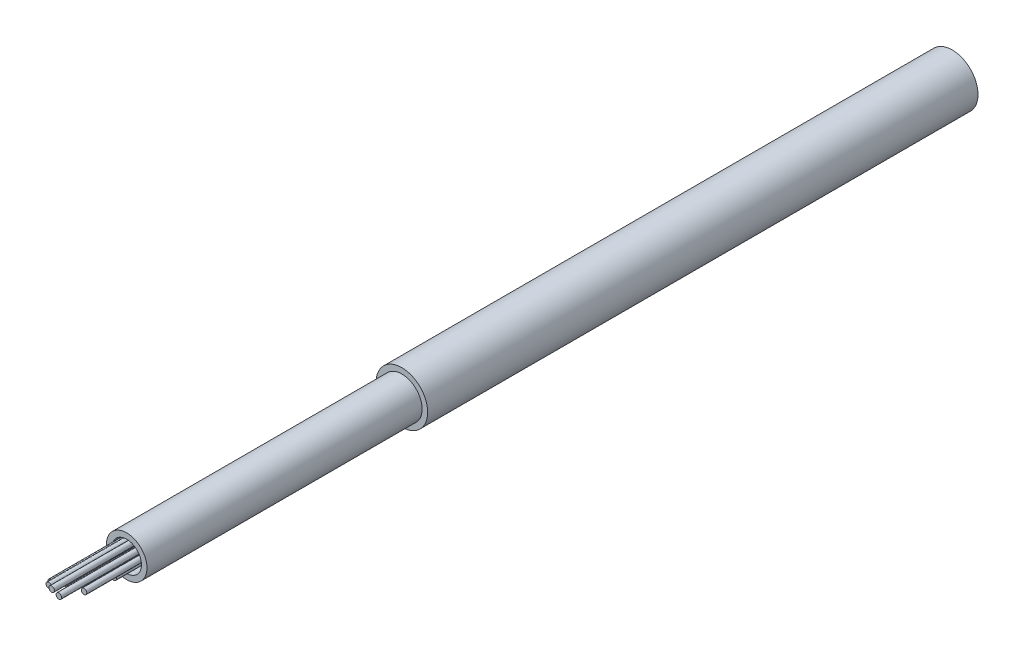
ISO-10303-21;
HEADER;
FILE_DESCRIPTION(('STEP AP214'),'2;1');
FILE_NAME('part.step','',(''),(''),'','','');
FILE_SCHEMA(('AUTOMOTIVE_DESIGN { 1 0 10303 214 1 1 1 1 }'));
ENDSEC;
DATA;
#1=APPLICATION_CONTEXT('core data for automotive mechanical design processes');
#2=APPLICATION_PROTOCOL_DEFINITION('international standard','automotive_design',2000,#1);
#3=PRODUCT_CONTEXT('',#1,'mechanical');
#4=PRODUCT('Part','Part','',(#3));
#5=PRODUCT_RELATED_PRODUCT_CATEGORY('part','',(#4));
#6=PRODUCT_DEFINITION_FORMATION('','',#4);
#7=PRODUCT_DEFINITION_CONTEXT('part definition',#1,'design');
#8=PRODUCT_DEFINITION('design','',#6,#7);
#9=PRODUCT_DEFINITION_SHAPE('','',#8);
#10=(LENGTH_UNIT() NAMED_UNIT(*) SI_UNIT(.MILLI.,.METRE.));
#11=(NAMED_UNIT(*) PLANE_ANGLE_UNIT() SI_UNIT($,.RADIAN.));
#12=(NAMED_UNIT(*) SI_UNIT($,.STERADIAN.) SOLID_ANGLE_UNIT());
#13=UNCERTAINTY_MEASURE_WITH_UNIT(LENGTH_MEASURE(1.E-05),#10,'distance_accuracy_value','');
#14=(GEOMETRIC_REPRESENTATION_CONTEXT(3) GLOBAL_UNCERTAINTY_ASSIGNED_CONTEXT((#13)) GLOBAL_UNIT_ASSIGNED_CONTEXT((#10,
#11,#12)) REPRESENTATION_CONTEXT('',''));
#15=CARTESIAN_POINT('',(0.,0.,0.));
#16=DIRECTION('',(0.,0.,1.));
#17=DIRECTION('',(1.,0.,0.));
#18=AXIS2_PLACEMENT_3D('',#15,#16,#17);
#19=CARTESIAN_POINT('',(10.6322908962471,6.39473379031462,81.5129893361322));
#20=DIRECTION('',(0.,0.,-1.));
#21=DIRECTION('',(-1.,0.,0.));
#22=AXIS2_PLACEMENT_3D('',#19,#20,#21);
#23=CYLINDRICAL_SURFACE('',#22,0.254000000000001);
#24=CARTESIAN_POINT('',(10.6322908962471,6.39473379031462,81.5129893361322));
#25=DIRECTION('',(0.,0.,1.));
#26=DIRECTION('',(1.,0.,0.));
#27=AXIS2_PLACEMENT_3D('',#24,#25,#26);
#28=CIRCLE('',#27,0.254000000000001);
#29=CARTESIAN_POINT('',(10.8862908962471,6.39473379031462,81.5129893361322));
#30=VERTEX_POINT('',#29);
#31=EDGE_CURVE('P0_E10',#30,#30,#28,.T.);
#32=ORIENTED_EDGE('',*,*,#31,.F.);
#33=EDGE_LOOP('',(#32));
#34=FACE_BOUND('',#33,.T.);
#35=CARTESIAN_POINT('',(10.6322908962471,6.39473379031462,30.7129893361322));
#36=DIRECTION('',(0.,0.,1.));
#37=DIRECTION('',(1.,0.,0.));
#38=AXIS2_PLACEMENT_3D('',#35,#36,#37);
#39=CIRCLE('',#38,0.254000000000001);
#40=CARTESIAN_POINT('',(10.8862908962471,6.39473379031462,30.7129893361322));
#41=VERTEX_POINT('',#40);
#42=EDGE_CURVE('P0_E17',#41,#41,#39,.T.);
#43=ORIENTED_EDGE('',*,*,#42,.T.);
#44=EDGE_LOOP('',(#43));
#45=FACE_BOUND('',#44,.T.);
#46=ADVANCED_FACE('P0_F14',(#34,#45),#23,.T.);
#47=CARTESIAN_POINT('',(10.6322908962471,6.39473379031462,81.5129893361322));
#48=DIRECTION('',(0.,0.,1.));
#49=DIRECTION('',(1.,0.,0.));
#50=AXIS2_PLACEMENT_3D('',#47,#48,#49);
#51=PLANE('',#50);
#52=ORIENTED_EDGE('',*,*,#31,.T.);
#53=EDGE_LOOP('',(#52));
#54=FACE_BOUND('',#53,.T.);
#55=ADVANCED_FACE('P0_F29',(#54),#51,.T.);
#56=CARTESIAN_POINT('',(10.6322908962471,6.39473379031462,30.7129893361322));
#57=DIRECTION('',(0.,0.,1.));
#58=DIRECTION('',(1.,0.,0.));
#59=AXIS2_PLACEMENT_3D('',#56,#57,#58);
#60=PLANE('',#59);
#61=ORIENTED_EDGE('',*,*,#42,.F.);
#62=EDGE_LOOP('',(#61));
#63=FACE_BOUND('',#62,.T.);
#64=ADVANCED_FACE('P0_F27',(#63),#60,.F.);
#65=CLOSED_SHELL('',(#46,#55,#64));
#66=MANIFOLD_SOLID_BREP('P0_B1',#65);
#67=CARTESIAN_POINT('',(9.5810484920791,6.71626141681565,82.0601210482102));
#68=DIRECTION('',(0.,0.,-1.));
#69=DIRECTION('',(-1.,0.,0.));
#70=AXIS2_PLACEMENT_3D('',#67,#68,#69);
#71=CYLINDRICAL_SURFACE('',#70,0.254000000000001);
#72=CARTESIAN_POINT('',(9.5810484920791,6.71626141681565,82.0601210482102));
#73=DIRECTION('',(0.,0.,1.));
#74=DIRECTION('',(1.,0.,0.));
#75=AXIS2_PLACEMENT_3D('',#72,#73,#74);
#76=CIRCLE('',#75,0.254000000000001);
#77=CARTESIAN_POINT('',(9.8350484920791,6.71626141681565,82.0601210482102));
#78=VERTEX_POINT('',#77);
#79=EDGE_CURVE('P1_E10',#78,#78,#76,.T.);
#80=ORIENTED_EDGE('',*,*,#79,.F.);
#81=EDGE_LOOP('',(#80));
#82=FACE_BOUND('',#81,.T.);
#83=CARTESIAN_POINT('',(9.5810484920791,6.71626141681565,31.2601210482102));
#84=DIRECTION('',(0.,0.,1.));
#85=DIRECTION('',(1.,0.,0.));
#86=AXIS2_PLACEMENT_3D('',#83,#84,#85);
#87=CIRCLE('',#86,0.254000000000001);
#88=CARTESIAN_POINT('',(9.8350484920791,6.71626141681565,31.2601210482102));
#89=VERTEX_POINT('',#88);
#90=EDGE_CURVE('P1_E17',#89,#89,#87,.T.);
#91=ORIENTED_EDGE('',*,*,#90,.T.);
#92=EDGE_LOOP('',(#91));
#93=FACE_BOUND('',#92,.T.);
#94=ADVANCED_FACE('P1_F14',(#82,#93),#71,.T.);
#95=CARTESIAN_POINT('',(9.5810484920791,6.71626141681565,82.0601210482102));
#96=DIRECTION('',(0.,0.,1.));
#97=DIRECTION('',(1.,0.,0.));
#98=AXIS2_PLACEMENT_3D('',#95,#96,#97);
#99=PLANE('',#98);
#100=ORIENTED_EDGE('',*,*,#79,.T.);
#101=EDGE_LOOP('',(#100));
#102=FACE_BOUND('',#101,.T.);
#103=ADVANCED_FACE('P1_F29',(#102),#99,.T.);
#104=CARTESIAN_POINT('',(9.5810484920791,6.71626141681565,31.2601210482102));
#105=DIRECTION('',(0.,0.,1.));
#106=DIRECTION('',(1.,0.,0.));
#107=AXIS2_PLACEMENT_3D('',#104,#105,#106);
#108=PLANE('',#107);
#109=ORIENTED_EDGE('',*,*,#90,.F.);
#110=EDGE_LOOP('',(#109));
#111=FACE_BOUND('',#110,.T.);
#112=ADVANCED_FACE('P1_F27',(#111),#108,.F.);
#113=CLOSED_SHELL('',(#94,#103,#112));
#114=MANIFOLD_SOLID_BREP('P1_B1',#113);
#115=CARTESIAN_POINT('',(10.3570924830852,5.58361357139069,79.5122965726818));
#116=DIRECTION('',(0.,0.,-1.));
#117=DIRECTION('',(-1.,0.,0.));
#118=AXIS2_PLACEMENT_3D('',#115,#116,#117);
#119=CYLINDRICAL_SURFACE('',#118,0.254000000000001);
#120=CARTESIAN_POINT('',(10.3570924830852,5.58361357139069,79.5122965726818));
#121=DIRECTION('',(0.,0.,1.));
#122=DIRECTION('',(1.,0.,0.));
#123=AXIS2_PLACEMENT_3D('',#120,#121,#122);
#124=CIRCLE('',#123,0.254000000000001);
#125=CARTESIAN_POINT('',(10.6110924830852,5.58361357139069,79.5122965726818));
#126=VERTEX_POINT('',#125);
#127=EDGE_CURVE('P2_E10',#126,#126,#124,.T.);
#128=ORIENTED_EDGE('',*,*,#127,.F.);
#129=EDGE_LOOP('',(#128));
#130=FACE_BOUND('',#129,.T.);
#131=CARTESIAN_POINT('',(10.3570924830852,5.58361357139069,28.7122965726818));
#132=DIRECTION('',(0.,0.,1.));
#133=DIRECTION('',(1.,0.,0.));
#134=AXIS2_PLACEMENT_3D('',#131,#132,#133);
#135=CIRCLE('',#134,0.254000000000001);
#136=CARTESIAN_POINT('',(10.6110924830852,5.58361357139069,28.7122965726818));
#137=VERTEX_POINT('',#136);
#138=EDGE_CURVE('P2_E17',#137,#137,#135,.T.);
#139=ORIENTED_EDGE('',*,*,#138,.T.);
#140=EDGE_LOOP('',(#139));
#141=FACE_BOUND('',#140,.T.);
#142=ADVANCED_FACE('P2_F14',(#130,#141),#119,.T.);
#143=CARTESIAN_POINT('',(10.3570924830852,5.58361357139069,79.5122965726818));
#144=DIRECTION('',(0.,0.,1.));
#145=DIRECTION('',(1.,0.,0.));
#146=AXIS2_PLACEMENT_3D('',#143,#144,#145);
#147=PLANE('',#146);
#148=ORIENTED_EDGE('',*,*,#127,.T.);
#149=EDGE_LOOP('',(#148));
#150=FACE_BOUND('',#149,.T.);
#151=ADVANCED_FACE('P2_F29',(#150),#147,.T.);
#152=CARTESIAN_POINT('',(10.3570924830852,5.58361357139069,28.7122965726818));
#153=DIRECTION('',(0.,0.,1.));
#154=DIRECTION('',(1.,0.,0.));
#155=AXIS2_PLACEMENT_3D('',#152,#153,#154);
#156=PLANE('',#155);
#157=ORIENTED_EDGE('',*,*,#138,.F.);
#158=EDGE_LOOP('',(#157));
#159=FACE_BOUND('',#158,.T.);
#160=ADVANCED_FACE('P2_F27',(#159),#156,.F.);
#161=CLOSED_SHELL('',(#142,#151,#160));
#162=MANIFOLD_SOLID_BREP('P2_B1',#161);
#163=CARTESIAN_POINT('',(10.7683912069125,7.31828952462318,83.1597092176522));
#164=DIRECTION('',(0.,0.,-1.));
#165=DIRECTION('',(-1.,0.,0.));
#166=AXIS2_PLACEMENT_3D('',#163,#164,#165);
#167=CYLINDRICAL_SURFACE('',#166,0.254000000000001);
#168=CARTESIAN_POINT('',(10.7683912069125,7.31828952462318,83.1597092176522));
#169=DIRECTION('',(0.,0.,1.));
#170=DIRECTION('',(1.,0.,0.));
#171=AXIS2_PLACEMENT_3D('',#168,#169,#170);
#172=CIRCLE('',#171,0.254000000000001);
#173=CARTESIAN_POINT('',(11.0223912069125,7.31828952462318,83.1597092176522));
#174=VERTEX_POINT('',#173);
#175=EDGE_CURVE('P3_E10',#174,#174,#172,.T.);
#176=ORIENTED_EDGE('',*,*,#175,.F.);
#177=EDGE_LOOP('',(#176));
#178=FACE_BOUND('',#177,.T.);
#179=CARTESIAN_POINT('',(10.7683912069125,7.31828952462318,32.3597092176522));
#180=DIRECTION('',(0.,0.,1.));
#181=DIRECTION('',(1.,0.,0.));
#182=AXIS2_PLACEMENT_3D('',#179,#180,#181);
#183=CIRCLE('',#182,0.254000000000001);
#184=CARTESIAN_POINT('',(11.0223912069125,7.31828952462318,32.3597092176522));
#185=VERTEX_POINT('',#184);
#186=EDGE_CURVE('P3_E17',#185,#185,#183,.T.);
#187=ORIENTED_EDGE('',*,*,#186,.T.);
#188=EDGE_LOOP('',(#187));
#189=FACE_BOUND('',#188,.T.);
#190=ADVANCED_FACE('P3_F14',(#178,#189),#167,.T.);
#191=CARTESIAN_POINT('',(10.7683912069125,7.31828952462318,83.1597092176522));
#192=DIRECTION('',(0.,0.,1.));
#193=DIRECTION('',(1.,0.,0.));
#194=AXIS2_PLACEMENT_3D('',#191,#192,#193);
#195=PLANE('',#194);
#196=ORIENTED_EDGE('',*,*,#175,.T.);
#197=EDGE_LOOP('',(#196));
#198=FACE_BOUND('',#197,.T.);
#199=ADVANCED_FACE('P3_F29',(#198),#195,.T.);
#200=CARTESIAN_POINT('',(10.7683912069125,7.31828952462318,32.3597092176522));
#201=DIRECTION('',(0.,0.,1.));
#202=DIRECTION('',(1.,0.,0.));
#203=AXIS2_PLACEMENT_3D('',#200,#201,#202);
#204=PLANE('',#203);
#205=ORIENTED_EDGE('',*,*,#186,.F.);
#206=EDGE_LOOP('',(#205));
#207=FACE_BOUND('',#206,.T.);
#208=ADVANCED_FACE('P3_F27',(#207),#204,.F.);
#209=CLOSED_SHELL('',(#190,#199,#208));
#210=MANIFOLD_SOLID_BREP('P3_B1',#209);
#211=CARTESIAN_POINT('',(10.8691099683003,5.5131505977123,77.5322859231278));
#212=DIRECTION('',(0.,0.,-1.));
#213=DIRECTION('',(-1.,0.,0.));
#214=AXIS2_PLACEMENT_3D('',#211,#212,#213);
#215=CYLINDRICAL_SURFACE('',#214,0.254000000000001);
#216=CARTESIAN_POINT('',(10.8691099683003,5.5131505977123,77.5322859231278));
#217=DIRECTION('',(0.,0.,1.));
#218=DIRECTION('',(1.,0.,0.));
#219=AXIS2_PLACEMENT_3D('',#216,#217,#218);
#220=CIRCLE('',#219,0.254000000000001);
#221=CARTESIAN_POINT('',(11.1231099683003,5.5131505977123,77.5322859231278));
#222=VERTEX_POINT('',#221);
#223=EDGE_CURVE('P4_E10',#222,#222,#220,.T.);
#224=ORIENTED_EDGE('',*,*,#223,.F.);
#225=EDGE_LOOP('',(#224));
#226=FACE_BOUND('',#225,.T.);
#227=CARTESIAN_POINT('',(10.8691099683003,5.5131505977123,26.7322859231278));
#228=DIRECTION('',(0.,0.,1.));
#229=DIRECTION('',(1.,0.,0.));
#230=AXIS2_PLACEMENT_3D('',#227,#228,#229);
#231=CIRCLE('',#230,0.254000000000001);
#232=CARTESIAN_POINT('',(11.1231099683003,5.5131505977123,26.7322859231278));
#233=VERTEX_POINT('',#232);
#234=EDGE_CURVE('P4_E17',#233,#233,#231,.T.);
#235=ORIENTED_EDGE('',*,*,#234,.T.);
#236=EDGE_LOOP('',(#235));
#237=FACE_BOUND('',#236,.T.);
#238=ADVANCED_FACE('P4_F14',(#226,#237),#215,.T.);
#239=CARTESIAN_POINT('',(10.8691099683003,5.5131505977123,77.5322859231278));
#240=DIRECTION('',(0.,0.,1.));
#241=DIRECTION('',(1.,0.,0.));
#242=AXIS2_PLACEMENT_3D('',#239,#240,#241);
#243=PLANE('',#242);
#244=ORIENTED_EDGE('',*,*,#223,.T.);
#245=EDGE_LOOP('',(#244));
#246=FACE_BOUND('',#245,.T.);
#247=ADVANCED_FACE('P4_F29',(#246),#243,.T.);
#248=CARTESIAN_POINT('',(10.8691099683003,5.5131505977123,26.7322859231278));
#249=DIRECTION('',(0.,0.,1.));
#250=DIRECTION('',(1.,0.,0.));
#251=AXIS2_PLACEMENT_3D('',#248,#249,#250);
#252=PLANE('',#251);
#253=ORIENTED_EDGE('',*,*,#234,.F.);
#254=EDGE_LOOP('',(#253));
#255=FACE_BOUND('',#254,.T.);
#256=ADVANCED_FACE('P4_F27',(#255),#252,.F.);
#257=CLOSED_SHELL('',(#238,#247,#256));
#258=MANIFOLD_SOLID_BREP('P4_B1',#257);
#259=CARTESIAN_POINT('',(11.3579920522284,7.02232118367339,83.0852366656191));
#260=DIRECTION('',(0.,0.,-1.));
#261=DIRECTION('',(-1.,0.,0.));
#262=AXIS2_PLACEMENT_3D('',#259,#260,#261);
#263=CYLINDRICAL_SURFACE('',#262,0.254000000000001);
#264=CARTESIAN_POINT('',(11.3579920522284,7.02232118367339,83.0852366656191));
#265=DIRECTION('',(0.,0.,1.));
#266=DIRECTION('',(1.,0.,0.));
#267=AXIS2_PLACEMENT_3D('',#264,#265,#266);
#268=CIRCLE('',#267,0.254000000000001);
#269=CARTESIAN_POINT('',(11.6119920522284,7.02232118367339,83.0852366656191));
#270=VERTEX_POINT('',#269);
#271=EDGE_CURVE('P5_E10',#270,#270,#268,.T.);
#272=ORIENTED_EDGE('',*,*,#271,.F.);
#273=EDGE_LOOP('',(#272));
#274=FACE_BOUND('',#273,.T.);
#275=CARTESIAN_POINT('',(11.3579920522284,7.02232118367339,32.2852366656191));
#276=DIRECTION('',(0.,0.,1.));
#277=DIRECTION('',(1.,0.,0.));
#278=AXIS2_PLACEMENT_3D('',#275,#276,#277);
#279=CIRCLE('',#278,0.254000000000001);
#280=CARTESIAN_POINT('',(11.6119920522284,7.02232118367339,32.2852366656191));
#281=VERTEX_POINT('',#280);
#282=EDGE_CURVE('P5_E17',#281,#281,#279,.T.);
#283=ORIENTED_EDGE('',*,*,#282,.T.);
#284=EDGE_LOOP('',(#283));
#285=FACE_BOUND('',#284,.T.);
#286=ADVANCED_FACE('P5_F14',(#274,#285),#263,.T.);
#287=CARTESIAN_POINT('',(11.3579920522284,7.02232118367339,83.0852366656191));
#288=DIRECTION('',(0.,0.,1.));
#289=DIRECTION('',(1.,0.,0.));
#290=AXIS2_PLACEMENT_3D('',#287,#288,#289);
#291=PLANE('',#290);
#292=ORIENTED_EDGE('',*,*,#271,.T.);
#293=EDGE_LOOP('',(#292));
#294=FACE_BOUND('',#293,.T.);
#295=ADVANCED_FACE('P5_F29',(#294),#291,.T.);
#296=CARTESIAN_POINT('',(11.3579920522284,7.02232118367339,32.2852366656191));
#297=DIRECTION('',(0.,0.,1.));
#298=DIRECTION('',(1.,0.,0.));
#299=AXIS2_PLACEMENT_3D('',#296,#297,#298);
#300=PLANE('',#299);
#301=ORIENTED_EDGE('',*,*,#282,.F.);
#302=EDGE_LOOP('',(#301));
#303=FACE_BOUND('',#302,.T.);
#304=ADVANCED_FACE('P5_F27',(#303),#300,.F.);
#305=CLOSED_SHELL('',(#286,#295,#304));
#306=MANIFOLD_SOLID_BREP('P5_B1',#305);
#307=CARTESIAN_POINT('',(10.254611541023,7.24387320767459,82.9160509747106));
#308=DIRECTION('',(0.,0.,-1.));
#309=DIRECTION('',(-1.,0.,0.));
#310=AXIS2_PLACEMENT_3D('',#307,#308,#309);
#311=CYLINDRICAL_SURFACE('',#310,0.254000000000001);
#312=CARTESIAN_POINT('',(10.254611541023,7.24387320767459,82.9160509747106));
#313=DIRECTION('',(0.,0.,1.));
#314=DIRECTION('',(1.,0.,0.));
#315=AXIS2_PLACEMENT_3D('',#312,#313,#314);
#316=CIRCLE('',#315,0.254000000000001);
#317=CARTESIAN_POINT('',(10.508611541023,7.24387320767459,82.9160509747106));
#318=VERTEX_POINT('',#317);
#319=EDGE_CURVE('P6_E10',#318,#318,#316,.T.);
#320=ORIENTED_EDGE('',*,*,#319,.F.);
#321=EDGE_LOOP('',(#320));
#322=FACE_BOUND('',#321,.T.);
#323=CARTESIAN_POINT('',(10.254611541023,7.24387320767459,32.1160509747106));
#324=DIRECTION('',(0.,0.,1.));
#325=DIRECTION('',(1.,0.,0.));
#326=AXIS2_PLACEMENT_3D('',#323,#324,#325);
#327=CIRCLE('',#326,0.254000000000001);
#328=CARTESIAN_POINT('',(10.508611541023,7.24387320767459,32.1160509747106));
#329=VERTEX_POINT('',#328);
#330=EDGE_CURVE('P6_E17',#329,#329,#327,.T.);
#331=ORIENTED_EDGE('',*,*,#330,.T.);
#332=EDGE_LOOP('',(#331));
#333=FACE_BOUND('',#332,.T.);
#334=ADVANCED_FACE('P6_F14',(#322,#333),#311,.T.);
#335=CARTESIAN_POINT('',(10.254611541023,7.24387320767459,82.9160509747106));
#336=DIRECTION('',(0.,0.,1.));
#337=DIRECTION('',(1.,0.,0.));
#338=AXIS2_PLACEMENT_3D('',#335,#336,#337);
#339=PLANE('',#338);
#340=ORIENTED_EDGE('',*,*,#319,.T.);
#341=EDGE_LOOP('',(#340));
#342=FACE_BOUND('',#341,.T.);
#343=ADVANCED_FACE('P6_F29',(#342),#339,.T.);
#344=CARTESIAN_POINT('',(10.254611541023,7.24387320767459,32.1160509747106));
#345=DIRECTION('',(0.,0.,1.));
#346=DIRECTION('',(1.,0.,0.));
#347=AXIS2_PLACEMENT_3D('',#344,#345,#346);
#348=PLANE('',#347);
#349=ORIENTED_EDGE('',*,*,#330,.F.);
#350=EDGE_LOOP('',(#349));
#351=FACE_BOUND('',#350,.T.);
#352=ADVANCED_FACE('P6_F27',(#351),#348,.F.);
#353=CLOSED_SHELL('',(#334,#343,#352));
#354=MANIFOLD_SOLID_BREP('P6_B1',#353);
#355=CARTESIAN_POINT('',(9.51987783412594,6.19947367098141,81.9412370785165));
#356=DIRECTION('',(0.,0.,-1.));
#357=DIRECTION('',(-1.,0.,0.));
#358=AXIS2_PLACEMENT_3D('',#355,#356,#357);
#359=CYLINDRICAL_SURFACE('',#358,0.254000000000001);
#360=CARTESIAN_POINT('',(9.51987783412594,6.19947367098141,81.9412370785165));
#361=DIRECTION('',(0.,0.,1.));
#362=DIRECTION('',(1.,0.,0.));
#363=AXIS2_PLACEMENT_3D('',#360,#361,#362);
#364=CIRCLE('',#363,0.254000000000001);
#365=CARTESIAN_POINT('',(9.77387783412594,6.19947367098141,81.9412370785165));
#366=VERTEX_POINT('',#365);
#367=EDGE_CURVE('P7_E10',#366,#366,#364,.T.);
#368=ORIENTED_EDGE('',*,*,#367,.F.);
#369=EDGE_LOOP('',(#368));
#370=FACE_BOUND('',#369,.T.);
#371=CARTESIAN_POINT('',(9.51987783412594,6.19947367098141,31.1412370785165));
#372=DIRECTION('',(0.,0.,1.));
#373=DIRECTION('',(1.,0.,0.));
#374=AXIS2_PLACEMENT_3D('',#371,#372,#373);
#375=CIRCLE('',#374,0.254000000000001);
#376=CARTESIAN_POINT('',(9.77387783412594,6.19947367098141,31.1412370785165));
#377=VERTEX_POINT('',#376);
#378=EDGE_CURVE('P7_E17',#377,#377,#375,.T.);
#379=ORIENTED_EDGE('',*,*,#378,.T.);
#380=EDGE_LOOP('',(#379));
#381=FACE_BOUND('',#380,.T.);
#382=ADVANCED_FACE('P7_F14',(#370,#381),#359,.T.);
#383=CARTESIAN_POINT('',(9.51987783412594,6.19947367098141,81.9412370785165));
#384=DIRECTION('',(0.,0.,1.));
#385=DIRECTION('',(1.,0.,0.));
#386=AXIS2_PLACEMENT_3D('',#383,#384,#385);
#387=PLANE('',#386);
#388=ORIENTED_EDGE('',*,*,#367,.T.);
#389=EDGE_LOOP('',(#388));
#390=FACE_BOUND('',#389,.T.);
#391=ADVANCED_FACE('P7_F29',(#390),#387,.T.);
#392=CARTESIAN_POINT('',(9.51987783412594,6.19947367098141,31.1412370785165));
#393=DIRECTION('',(0.,0.,1.));
#394=DIRECTION('',(1.,0.,0.));
#395=AXIS2_PLACEMENT_3D('',#392,#393,#394);
#396=PLANE('',#395);
#397=ORIENTED_EDGE('',*,*,#378,.F.);
#398=EDGE_LOOP('',(#397));
#399=FACE_BOUND('',#398,.T.);
#400=ADVANCED_FACE('P7_F27',(#399),#396,.F.);
#401=CLOSED_SHELL('',(#382,#391,#400));
#402=MANIFOLD_SOLID_BREP('P7_B1',#401);
#403=CARTESIAN_POINT('',(10.5938874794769,6.30728248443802,50.6634364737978));
#404=DIRECTION('',(0.,0.,1.));
#405=DIRECTION('',(1.,0.,0.));
#406=AXIS2_PLACEMENT_3D('',#403,#404,#405);
#407=PLANE('',#406);
#408=CARTESIAN_POINT('',(10.5938874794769,6.30728248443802,50.6634364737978));
#409=DIRECTION('',(0.,0.,1.));
#410=DIRECTION('',(1.,0.,0.));
#411=AXIS2_PLACEMENT_3D('',#408,#409,#410);
#412=CIRCLE('',#411,2.38125);
#413=CARTESIAN_POINT('',(12.9751374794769,6.30728248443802,50.6634364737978));
#414=VERTEX_POINT('',#413);
#415=EDGE_CURVE('P8_E10',#414,#414,#412,.T.);
#416=ORIENTED_EDGE('',*,*,#415,.T.);
#417=EDGE_LOOP('',(#416));
#418=FACE_BOUND('',#417,.T.);
#419=CARTESIAN_POINT('',(10.5938874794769,6.30728248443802,50.6634364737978));
#420=DIRECTION('',(0.,0.,1.));
#421=DIRECTION('',(1.,0.,0.));
#422=AXIS2_PLACEMENT_3D('',#419,#420,#421);
#423=CIRCLE('',#422,1.87325);
#424=CARTESIAN_POINT('',(12.4671374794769,6.30728248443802,50.6634364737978));
#425=VERTEX_POINT('',#424);
#426=EDGE_CURVE('P8_E27',#425,#425,#423,.T.);
#427=ORIENTED_EDGE('',*,*,#426,.F.);
#428=EDGE_LOOP('',(#427));
#429=FACE_BOUND('',#428,.T.);
#430=ADVANCED_FACE('P8_F14',(#418,#429),#407,.T.);
#431=CARTESIAN_POINT('',(10.5938874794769,6.30728248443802,50.6634364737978));
#432=DIRECTION('',(0.,0.,-1.));
#433=DIRECTION('',(-1.,0.,0.));
#434=AXIS2_PLACEMENT_3D('',#431,#432,#433);
#435=CYLINDRICAL_SURFACE('',#434,2.38125);
#436=ORIENTED_EDGE('',*,*,#415,.F.);
#437=EDGE_LOOP('',(#436));
#438=FACE_BOUND('',#437,.T.);
#439=CARTESIAN_POINT('',(10.5938874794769,6.30728248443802,-0.136563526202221));
#440=DIRECTION('',(0.,0.,1.));
#441=DIRECTION('',(1.,0.,0.));
#442=AXIS2_PLACEMENT_3D('',#439,#440,#441);
#443=CIRCLE('',#442,2.38125);
#444=CARTESIAN_POINT('',(12.9751374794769,6.30728248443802,-0.136563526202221));
#445=VERTEX_POINT('',#444);
#446=EDGE_CURVE('P8_E18',#445,#445,#443,.T.);
#447=ORIENTED_EDGE('',*,*,#446,.T.);
#448=EDGE_LOOP('',(#447));
#449=FACE_BOUND('',#448,.T.);
#450=ADVANCED_FACE('P8_F16',(#438,#449),#435,.T.);
#451=CARTESIAN_POINT('',(10.5938874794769,6.30728248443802,-0.136563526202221));
#452=DIRECTION('',(0.,0.,1.));
#453=DIRECTION('',(1.,0.,0.));
#454=AXIS2_PLACEMENT_3D('',#451,#452,#453);
#455=PLANE('',#454);
#456=ORIENTED_EDGE('',*,*,#446,.F.);
#457=EDGE_LOOP('',(#456));
#458=FACE_BOUND('',#457,.T.);
#459=ADVANCED_FACE('P8_F56',(#458),#455,.F.);
#460=CARTESIAN_POINT('',(10.5938874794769,6.30728248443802,76.0634364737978));
#461=DIRECTION('',(0.,0.,-1.));
#462=DIRECTION('',(-1.,0.,0.));
#463=AXIS2_PLACEMENT_3D('',#460,#461,#462);
#464=CYLINDRICAL_SURFACE('',#463,1.87325);
#465=CARTESIAN_POINT('',(10.5938874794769,6.30728248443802,76.0634364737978));
#466=DIRECTION('',(0.,0.,1.));
#467=DIRECTION('',(1.,0.,0.));
#468=AXIS2_PLACEMENT_3D('',#465,#466,#467);
#469=CIRCLE('',#468,1.87325);
#470=CARTESIAN_POINT('',(12.4671374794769,6.30728248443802,76.0634364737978));
#471=VERTEX_POINT('',#470);
#472=EDGE_CURVE('P8_E25',#471,#471,#469,.T.);
#473=ORIENTED_EDGE('',*,*,#472,.F.);
#474=EDGE_LOOP('',(#473));
#475=FACE_BOUND('',#474,.T.);
#476=ORIENTED_EDGE('',*,*,#426,.T.);
#477=EDGE_LOOP('',(#476));
#478=FACE_BOUND('',#477,.T.);
#479=ADVANCED_FACE('P8_F50',(#475,#478),#464,.T.);
#480=CARTESIAN_POINT('',(10.5938874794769,6.30728248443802,76.0634364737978));
#481=DIRECTION('',(0.,0.,1.));
#482=DIRECTION('',(1.,0.,0.));
#483=AXIS2_PLACEMENT_3D('',#480,#481,#482);
#484=PLANE('',#483);
#485=CARTESIAN_POINT('',(10.5938874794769,6.30728248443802,76.0634364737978));
#486=DIRECTION('',(0.,0.,1.));
#487=DIRECTION('',(1.,0.,0.));
#488=AXIS2_PLACEMENT_3D('',#485,#486,#487);
#489=CIRCLE('',#488,1.36525);
#490=CARTESIAN_POINT('',(11.9591374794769,6.30728248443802,76.0634364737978));
#491=VERTEX_POINT('',#490);
#492=EDGE_CURVE('P8_E33',#491,#491,#489,.T.);
#493=ORIENTED_EDGE('',*,*,#492,.F.);
#494=EDGE_LOOP('',(#493));
#495=FACE_BOUND('',#494,.T.);
#496=ORIENTED_EDGE('',*,*,#472,.T.);
#497=EDGE_LOOP('',(#496));
#498=FACE_BOUND('',#497,.T.);
#499=ADVANCED_FACE('P8_F44',(#495,#498),#484,.T.);
#500=CARTESIAN_POINT('',(10.5938874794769,6.30728248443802,25.2634364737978));
#501=DIRECTION('',(0.,0.,1.));
#502=DIRECTION('',(1.,0.,0.));
#503=AXIS2_PLACEMENT_3D('',#500,#501,#502);
#504=CYLINDRICAL_SURFACE('',#503,1.36525);
#505=CARTESIAN_POINT('',(10.5938874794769,6.30728248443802,25.2634364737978));
#506=DIRECTION('',(0.,0.,1.));
#507=DIRECTION('',(1.,0.,0.));
#508=AXIS2_PLACEMENT_3D('',#505,#506,#507);
#509=CIRCLE('',#508,1.36525);
#510=CARTESIAN_POINT('',(11.9591374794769,6.30728248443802,25.2634364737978));
#511=VERTEX_POINT('',#510);
#512=EDGE_CURVE('P8_E30',#511,#511,#509,.T.);
#513=ORIENTED_EDGE('',*,*,#512,.F.);
#514=EDGE_LOOP('',(#513));
#515=FACE_BOUND('',#514,.T.);
#516=ORIENTED_EDGE('',*,*,#492,.T.);
#517=EDGE_LOOP('',(#516));
#518=FACE_BOUND('',#517,.T.);
#519=ADVANCED_FACE('P8_F41',(#515,#518),#504,.F.);
#520=CARTESIAN_POINT('',(10.5938874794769,6.30728248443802,25.2634364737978));
#521=DIRECTION('',(0.,0.,1.));
#522=DIRECTION('',(1.,0.,0.));
#523=AXIS2_PLACEMENT_3D('',#520,#521,#522);
#524=PLANE('',#523);
#525=ORIENTED_EDGE('',*,*,#512,.T.);
#526=EDGE_LOOP('',(#525));
#527=FACE_BOUND('',#526,.T.);
#528=ADVANCED_FACE('P8_F39',(#527),#524,.T.);
#529=CLOSED_SHELL('',(#430,#450,#459,#479,#499,#519,#528));
#530=MANIFOLD_SOLID_BREP('P8_B1',#529);
#531=CARTESIAN_POINT('',(11.6262747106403,6.50068533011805,81.0322513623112));
#532=DIRECTION('',(0.,0.,-1.));
#533=DIRECTION('',(-1.,0.,0.));
#534=AXIS2_PLACEMENT_3D('',#531,#532,#533);
#535=CYLINDRICAL_SURFACE('',#534,0.254000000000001);
#536=CARTESIAN_POINT('',(11.6262747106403,6.50068533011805,81.0322513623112));
#537=DIRECTION('',(0.,0.,1.));
#538=DIRECTION('',(1.,0.,0.));
#539=AXIS2_PLACEMENT_3D('',#536,#537,#538);
#540=CIRCLE('',#539,0.254000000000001);
#541=CARTESIAN_POINT('',(11.8802747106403,6.50068533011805,81.0322513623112));
#542=VERTEX_POINT('',#541);
#543=EDGE_CURVE('P9_E10',#542,#542,#540,.T.);
#544=ORIENTED_EDGE('',*,*,#543,.F.);
#545=EDGE_LOOP('',(#544));
#546=FACE_BOUND('',#545,.T.);
#547=CARTESIAN_POINT('',(11.6262747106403,6.50068533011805,30.2322513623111));
#548=DIRECTION('',(0.,0.,1.));
#549=DIRECTION('',(1.,0.,0.));
#550=AXIS2_PLACEMENT_3D('',#547,#548,#549);
#551=CIRCLE('',#550,0.254000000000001);
#552=CARTESIAN_POINT('',(11.8802747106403,6.50068533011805,30.2322513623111));
#553=VERTEX_POINT('',#552);
#554=EDGE_CURVE('P9_E17',#553,#553,#551,.T.);
#555=ORIENTED_EDGE('',*,*,#554,.T.);
#556=EDGE_LOOP('',(#555));
#557=FACE_BOUND('',#556,.T.);
#558=ADVANCED_FACE('P9_F14',(#546,#557),#535,.T.);
#559=CARTESIAN_POINT('',(11.6262747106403,6.50068533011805,81.0322513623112));
#560=DIRECTION('',(0.,0.,1.));
#561=DIRECTION('',(1.,0.,0.));
#562=AXIS2_PLACEMENT_3D('',#559,#560,#561);
#563=PLANE('',#562);
#564=ORIENTED_EDGE('',*,*,#543,.T.);
#565=EDGE_LOOP('',(#564));
#566=FACE_BOUND('',#565,.T.);
#567=ADVANCED_FACE('P9_F29',(#566),#563,.T.);
#568=CARTESIAN_POINT('',(11.6262747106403,6.50068533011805,30.2322513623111));
#569=DIRECTION('',(0.,0.,1.));
#570=DIRECTION('',(1.,0.,0.));
#571=AXIS2_PLACEMENT_3D('',#568,#569,#570);
#572=PLANE('',#571);
#573=ORIENTED_EDGE('',*,*,#554,.F.);
#574=EDGE_LOOP('',(#573));
#575=FACE_BOUND('',#574,.T.);
#576=ADVANCED_FACE('P9_F27',(#575),#572,.F.);
#577=CLOSED_SHELL('',(#558,#567,#576));
#578=MANIFOLD_SOLID_BREP('P9_B1',#577);
#579=ADVANCED_BREP_SHAPE_REPRESENTATION('',(#18,#66,#114,#162,#210,#258,#306,#354,#402,#530,
#578),#14);
#580=SHAPE_DEFINITION_REPRESENTATION(#9,#579);
ENDSEC;
END-ISO-10303-21;
